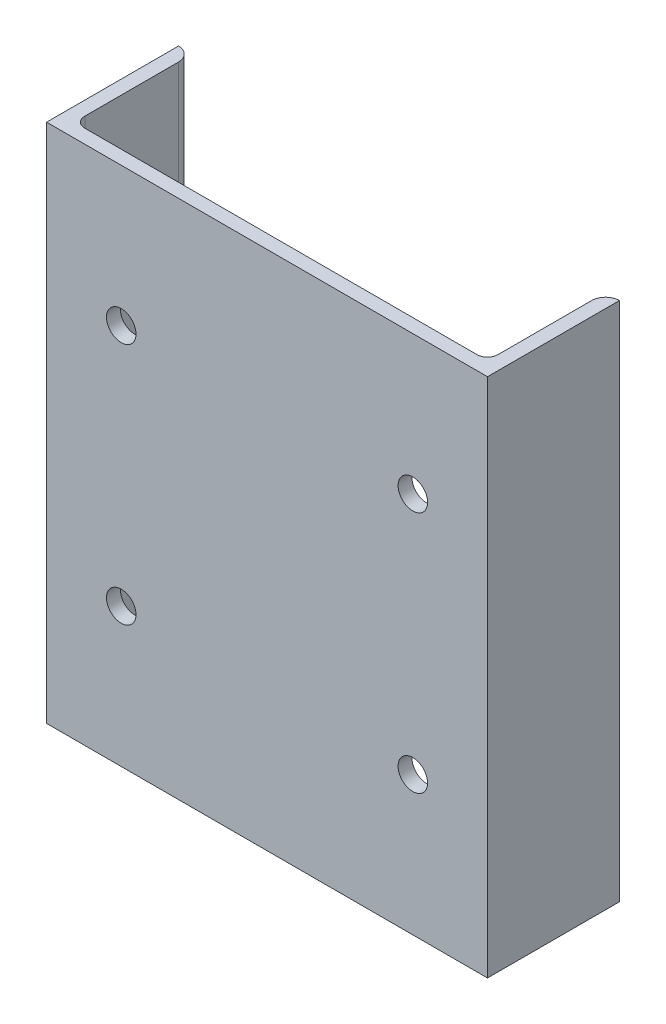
from build123d import *

# Parameters (mm, degrees)
EXTRUDE1_DEPTH     = 150
CUT_EXTRUDE1_REACH = 212.725
SKETCH2_R          = 8.5


with BuildPart() as part:
    # Sketch1 → Extrude1 (new, symmetric)
    with BuildSketch(Plane(origin=(0, 0, 0), x_dir=(1, 0, 0), z_dir=(0, 1, 0))):
        with BuildLine():
            Line((-127, 0), (127, 0))
            Line((127, 0), (127, 76))
            ThreePointArc((127, 76), (121.343145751, 73.656854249), (119, 68))
            Line((119, 68), (119, 14))
            ThreePointArc((119, 14), (117.242640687, 9.757359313), (113, 8))
            Line((113, 8), (-113, 8))
            ThreePointArc((-113, 8), (-117.242640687, 9.757359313), (-119, 14))
            Line((-119, 14), (-119, 68))
            ThreePointArc((-119, 68), (-121.343145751, 73.656854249), (-127, 76))
            Line((-127, 76), (-127, 0))
        make_face()
    extrude(amount=EXTRUDE1_DEPTH, both=True)

    # Sketch2 → Cut-Extrude1 (cut, up to next)
    with BuildSketch(Plane.XY, mode=Mode.PRIVATE) as cut_extrude1_sk1:
        with Locations((84, 70)):
            Circle(SKETCH2_R)
    cut_extrude1_tool1 = extrude(cut_extrude1_sk1.sketch, amount=-CUT_EXTRUDE1_REACH, mode=Mode.PRIVATE) & part.part
    # Sketch2 → Cut-Extrude1 (cut, up to next)
    with BuildSketch(Plane.XY, mode=Mode.PRIVATE) as cut_extrude1_sk2:
        with Locations((-84, 70)):
            Circle(SKETCH2_R)
    cut_extrude1_tool2 = extrude(cut_extrude1_sk2.sketch, amount=-CUT_EXTRUDE1_REACH, mode=Mode.PRIVATE) & part.part
    # Sketch2 → Cut-Extrude1 (cut, up to next)
    with BuildSketch(Plane.XY, mode=Mode.PRIVATE) as cut_extrude1_sk3:
        with Locations((-84, -70)):
            Circle(SKETCH2_R)
    cut_extrude1_tool3 = extrude(cut_extrude1_sk3.sketch, amount=-CUT_EXTRUDE1_REACH, mode=Mode.PRIVATE) & part.part
    # Sketch2 → Cut-Extrude1 (cut, up to next)
    with BuildSketch(Plane.XY, mode=Mode.PRIVATE) as cut_extrude1_sk4:
        with Locations((84, -70)):
            Circle(SKETCH2_R)
    cut_extrude1_tool4 = extrude(cut_extrude1_sk4.sketch, amount=-CUT_EXTRUDE1_REACH, mode=Mode.PRIVATE) & part.part
    add(cut_extrude1_tool1.solids().sort_by_distance((84, 70, 0))[0], mode=Mode.SUBTRACT)
    add(cut_extrude1_tool2.solids().sort_by_distance((-84, 70, 0))[0], mode=Mode.SUBTRACT)
    add(cut_extrude1_tool3.solids().sort_by_distance((-84, -70, 0))[0], mode=Mode.SUBTRACT)
    add(cut_extrude1_tool4.solids().sort_by_distance((84, -70, 0))[0], mode=Mode.SUBTRACT)


solid = part.part
